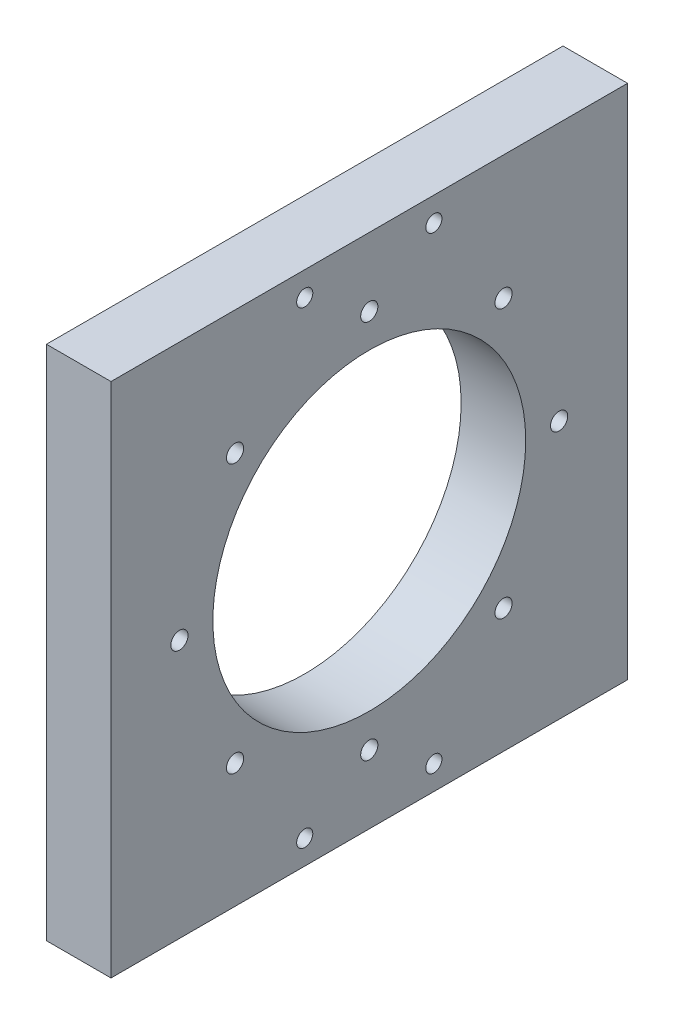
from build123d import *

# Parameters (mm, degrees)
SKETCH1_W               = 203.2
SKETCH1_H               = 203.2
SKETCH1_R               = 61.5315
BOSS_EXTRUDE2_DEPTH     = 25.4
F_1_4_20_TAPPED_HOLE2_D = 6.35
F_1_4_CLEARANCE_HOLE1_D = 6.7564
CIRPATTERN1_COUNT       = 8


with BuildPart() as part:
    # Sketch1 → Boss-Extrude2 (new body)
    with BuildSketch(Plane(origin=(0, 0, 0), x_dir=(0, 0, -1), z_dir=(1, 0, 0))):
        Rectangle(SKETCH1_W, SKETCH1_H)
        Circle(SKETCH1_R, mode=Mode.SUBTRACT)
    extrude(amount=BOSS_EXTRUDE2_DEPTH)

    # 1_4-20 Tapped Hole2 (through all)
    with Locations(Plane.ZY):
        with Locations((-25.4, -92.075), (25.4, -92.075)):
            f_1_4_20_tapped_hole2 = Hole(F_1_4_20_TAPPED_HOLE2_D / 2)

    # 1_4 Clearance Hole1 (through all)
    with Locations(Plane.ZY):
        with Locations((0, 74.676)):
            f_1_4_clearance_hole1 = Hole(F_1_4_CLEARANCE_HOLE1_D / 2)

    # CirPattern1: 1_4 Clearance Hole1 ×8 about axis
    cirpattern1_axis = Axis((0, 0, 0), (1, 0, 0))
    for i in range(1, CIRPATTERN1_COUNT):
        add(f_1_4_clearance_hole1.rotate(cirpattern1_axis, i * 360 / CIRPATTERN1_COUNT), mode=Mode.SUBTRACT)

    # Mirror1: 1_4-20 Tapped Hole2 across plane
    add(f_1_4_20_tapped_hole2.mirror(Plane.ZX), mode=Mode.SUBTRACT)


solid = part.part
